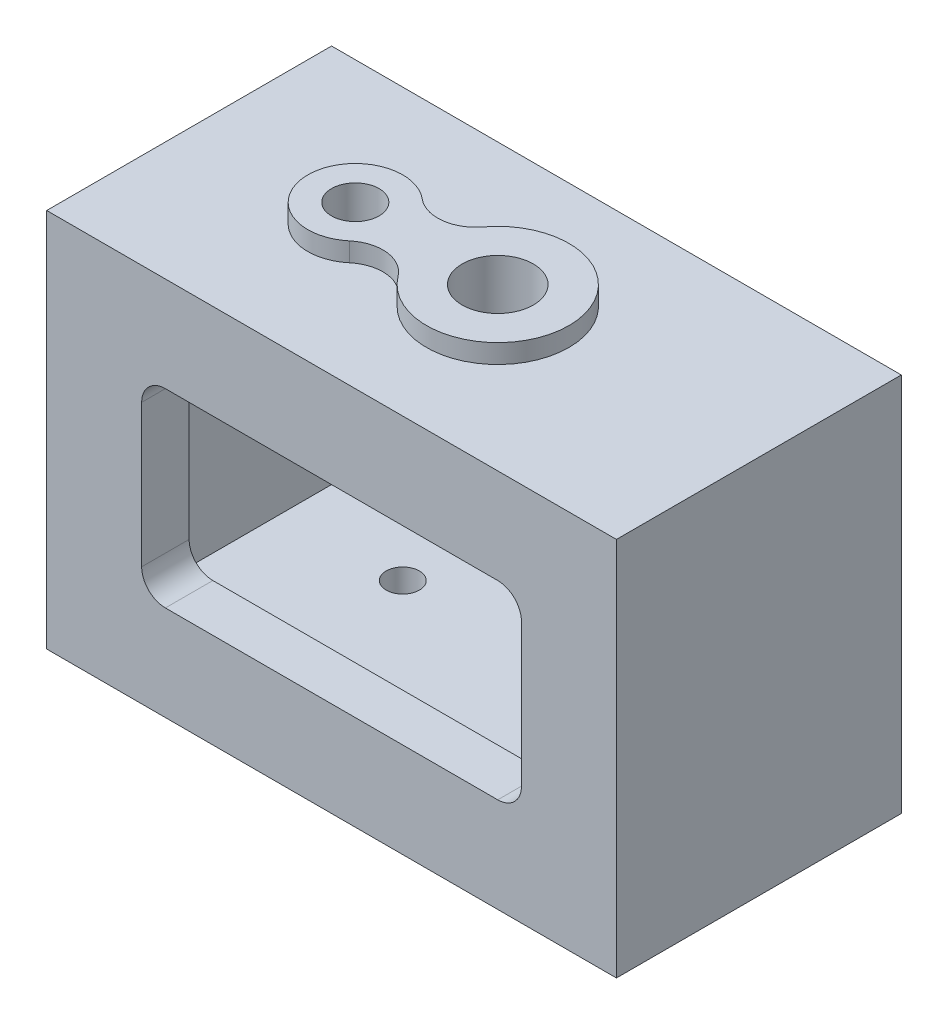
from build123d import *

# Parameters (mm, degrees)
SKETCH_1_W          = 120
SKETCH_1_H          = 60
SKETCH_1_W_2        = 100
SKETCH_1_H_2        = 40
EXTRUDE_1_DEPTH     = 60
SKETCH_2_W          = 120
SKETCH_2_H          = 60
EXTRUDE_2_DEPTH     = 10
SKETCH_3_W          = 120
SKETCH_3_H          = 60
EXTRUDE_3_DEPTH     = 10
CUT_EXTRUDE_1_DEPTH = 10
SKETCH_5_R          = 5
SKETCH_5_R_2        = 7.5
EXTRUDE_4_DEPTH     = 4
CUT_EXTRUDE_START   = -10
SKETCH_5_3_R        = 5
SKETCH_5_3_R_2      = 7.5
CUT_EXTRUDE_2_DEPTH = 10
SKETCH_6_R          = 7
SKETCH_6_R_2        = 3.5
EXTRUDE_5_DEPTH     = 4
SKETCH_6_2_R        = 3.5
CUT_EXTRUDE_3_DEPTH = 10


with BuildPart() as part:
    # Sketch 1 → Extrude 1 (new body)
    with BuildSketch(Plane(origin=(0, 0, 0), x_dir=(1, 0, 0), z_dir=(0, 1, 0))):
        Rectangle(SKETCH_1_W, SKETCH_1_H)
        Rectangle(SKETCH_1_W_2, SKETCH_1_H_2, mode=Mode.SUBTRACT)
    extrude(amount=EXTRUDE_1_DEPTH)

    # Sketch 2 → Extrude 2 (add)
    with BuildSketch(Plane(origin=(0, 60, 0), x_dir=(1, 0, 0), z_dir=(0, 1, 0))):
        Rectangle(SKETCH_2_W, SKETCH_2_H)
    extrude(amount=EXTRUDE_2_DEPTH)

    # Sketch 3 → Extrude 3 (add)
    with BuildSketch(Plane.XZ):
        Rectangle(SKETCH_3_W, SKETCH_3_H)
    extrude(amount=EXTRUDE_3_DEPTH)

    # Sketch 4 → Cut-Extrude 1 (cut)
    with BuildSketch(Plane.XY.offset(30)):
        with BuildLine():
            Line((35, 50), (-35, 50))
            ThreePointArc((-35, 50), (-38.535533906, 48.535533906), (-40, 45))
            Line((-40, 45), (-40, 15))
            ThreePointArc((-40, 15), (-38.535533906, 11.464466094), (-35, 10))
            Line((-35, 10), (35, 10))
            ThreePointArc((35, 10), (38.535533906, 11.464466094), (40, 15))
            Line((40, 15), (40, 45))
            ThreePointArc((40, 45), (38.535533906, 48.535533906), (35, 50))
        make_face()
    extrude(amount=-CUT_EXTRUDE_1_DEPTH, mode=Mode.SUBTRACT)

    # Sketch 5 → Extrude 4 (add)
    with BuildSketch(Plane(origin=(0, 70, 0), x_dir=(1, 0, 0), z_dir=(0, 1, 0))):
        with BuildLine():
            ThreePointArc((-18.564814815, 7.654305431), (-35, 0), (-18.564814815, -7.654305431))
            ThreePointArc((-18.564814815, -7.654305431), (-12.501006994, -5.830324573), (-7.010869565, -8.985488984))
            ThreePointArc((-7.010869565, -8.985488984), (20, 0), (-7.010869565, 8.985488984))
            ThreePointArc((-7.010869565, 8.985488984), (-12.501006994, 5.830324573), (-18.564814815, 7.654305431))
        make_face()
        with Locations(Location((-25, 0, 0), (0, 0, 270))):
            Circle(SKETCH_5_R, mode=Mode.SUBTRACT)
        with Locations(Location((5, 0, 0), (0, 0, 270))):
            Circle(SKETCH_5_R_2, mode=Mode.SUBTRACT)
    extrude(amount=EXTRUDE_4_DEPTH)

    # Sketch 5_3 → Cut-Extrude 2 (cut)
    with BuildSketch(Plane(origin=(0, 70, 0), x_dir=(1, 0, 0), z_dir=(0, 1, 0)).offset(CUT_EXTRUDE_START)):
        with Locations(Location((-25, 0, 0), (0, 0, 270))):
            Circle(SKETCH_5_3_R)
        with Locations(Location((5, 0, 0), (0, 0, 270))):
            Circle(SKETCH_5_3_R_2)
    extrude(amount=CUT_EXTRUDE_2_DEPTH, mode=Mode.SUBTRACT)

    # Sketch 6 → Extrude 5 (add)
    with BuildSketch(Plane.XZ.offset(10)):
        with Locations(Location((-25, -10, 0), (0, 0, 270))):
            Circle(SKETCH_6_R)
        with Locations(Location((-25, -10, 0), (0, 0, 270))):
            Circle(SKETCH_6_R_2, mode=Mode.SUBTRACT)
    extrude(amount=EXTRUDE_5_DEPTH)

    # Sketch 6_2 → Cut-Extrude 3 (cut)
    with BuildSketch(Plane.XZ.offset(10).offset(CUT_EXTRUDE_START)):
        with Locations(Location((-25, -10, 0), (0, 0, 270))):
            Circle(SKETCH_6_2_R)
    extrude(amount=CUT_EXTRUDE_3_DEPTH, mode=Mode.SUBTRACT)


solid = part.part
